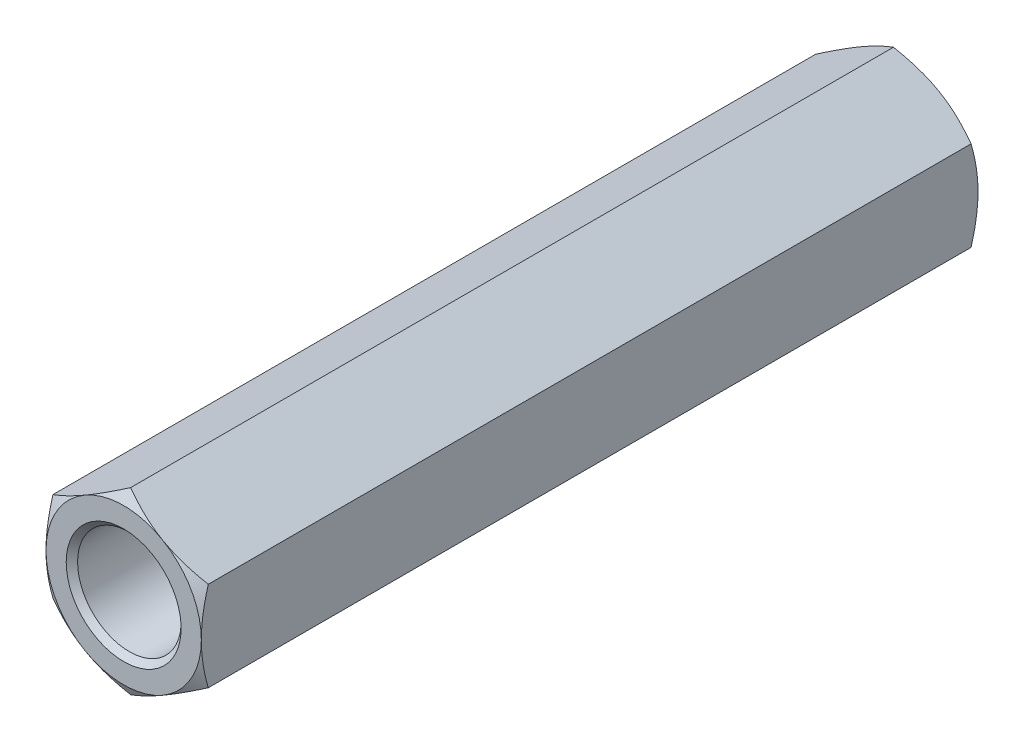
ISO-10303-21;
HEADER;
FILE_DESCRIPTION(('STEP AP214'),'2;1');
FILE_NAME('part.step','',(''),(''),'','','');
FILE_SCHEMA(('AUTOMOTIVE_DESIGN { 1 0 10303 214 1 1 1 1 }'));
ENDSEC;
DATA;
#1=APPLICATION_CONTEXT('core data for automotive mechanical design processes');
#2=APPLICATION_PROTOCOL_DEFINITION('international standard','automotive_design',2000,#1);
#3=PRODUCT_CONTEXT('',#1,'mechanical');
#4=PRODUCT('Part','Part','',(#3));
#5=PRODUCT_RELATED_PRODUCT_CATEGORY('part','',(#4));
#6=PRODUCT_DEFINITION_FORMATION('','',#4);
#7=PRODUCT_DEFINITION_CONTEXT('part definition',#1,'design');
#8=PRODUCT_DEFINITION('design','',#6,#7);
#9=PRODUCT_DEFINITION_SHAPE('','',#8);
#10=(LENGTH_UNIT() NAMED_UNIT(*) SI_UNIT(.MILLI.,.METRE.));
#11=(NAMED_UNIT(*) PLANE_ANGLE_UNIT() SI_UNIT($,.RADIAN.));
#12=(NAMED_UNIT(*) SI_UNIT($,.STERADIAN.) SOLID_ANGLE_UNIT());
#13=UNCERTAINTY_MEASURE_WITH_UNIT(LENGTH_MEASURE(1.E-05),#10,'distance_accuracy_value','');
#14=(GEOMETRIC_REPRESENTATION_CONTEXT(3) GLOBAL_UNCERTAINTY_ASSIGNED_CONTEXT((#13)) GLOBAL_UNIT_ASSIGNED_CONTEXT((#10,
#11,#12)) REPRESENTATION_CONTEXT('',''));
#15=CARTESIAN_POINT('',(0.,0.,0.));
#16=DIRECTION('',(0.,0.,1.));
#17=DIRECTION('',(1.,0.,0.));
#18=AXIS2_PLACEMENT_3D('',#15,#16,#17);
#19=CARTESIAN_POINT('',(15.,8.6602540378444,150.));
#20=DIRECTION('',(-0.5,-0.866025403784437,0.));
#21=DIRECTION('',(-0.866025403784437,0.5,0.));
#22=AXIS2_PLACEMENT_3D('',#19,#20,#21);
#23=PLANE('',#22);
#24=CARTESIAN_POINT('',(-0.000200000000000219,17.3206235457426,1.33981262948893));
#25=CARTESIAN_POINT('',(0.329494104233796,17.130274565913,1.22992178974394));
#26=CARTESIAN_POINT('',(0.660474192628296,16.9391831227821,1.12501758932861));
#27=CARTESIAN_POINT('',(1.32508844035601,16.5554679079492,0.92656858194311));
#28=CARTESIAN_POINT('',(1.6587234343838,16.3628436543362,0.833027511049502));
#29=CARTESIAN_POINT('',(2.32929228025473,15.9756905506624,0.658562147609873));
#30=CARTESIAN_POINT('',(2.66623200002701,15.7811583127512,0.577667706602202));
#31=CARTESIAN_POINT('',(3.34245276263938,15.3907420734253,0.43023264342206));
#32=CARTESIAN_POINT('',(3.68173367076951,15.1948581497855,0.363691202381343));
#33=CARTESIAN_POINT('',(4.35394314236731,14.8067578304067,0.247792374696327));
#34=CARTESIAN_POINT('',(4.68682180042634,14.6145702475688,0.198051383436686));
#35=CARTESIAN_POINT('',(5.35410443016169,14.2293144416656,0.114646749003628));
#36=CARTESIAN_POINT('',(5.68850843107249,14.0362462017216,0.0809834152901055));
#37=CARTESIAN_POINT('',(6.35787818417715,13.6497853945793,0.0305840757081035));
#38=CARTESIAN_POINT('',(6.69284279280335,13.4563934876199,0.0138279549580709));
#39=CARTESIAN_POINT('',(7.363081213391,13.0694311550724,-0.00239660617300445));
#40=CARTESIAN_POINT('',(7.69835501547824,12.8758607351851,-0.0018655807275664));
#41=CARTESIAN_POINT('',(8.32514688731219,12.5139822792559,0.0152766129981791));
#42=CARTESIAN_POINT('',(8.61670962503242,12.3456484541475,0.0297968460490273));
#43=CARTESIAN_POINT('',(9.19916443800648,12.0093680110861,0.071637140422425));
#44=CARTESIAN_POINT('',(9.49005646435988,11.8414214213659,0.0989581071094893));
#45=CARTESIAN_POINT('',(10.0710118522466,11.5060066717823,0.165923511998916));
#46=CARTESIAN_POINT('',(10.3610743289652,11.338539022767,0.205578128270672));
#47=CARTESIAN_POINT('',(10.939839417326,11.0043888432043,0.296515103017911));
#48=CARTESIAN_POINT('',(11.2285419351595,10.8377063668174,0.347798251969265));
#49=CARTESIAN_POINT('',(12.1049144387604,10.3317324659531,0.520386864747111));
#50=CARTESIAN_POINT('',(12.6900465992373,9.99390625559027,0.658901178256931));
#51=CARTESIAN_POINT('',(13.8515859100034,9.32329122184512,0.973271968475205));
#52=CARTESIAN_POINT('',(14.4280079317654,8.99049381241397,1.14905461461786));
#53=CARTESIAN_POINT('',(15.0002,8.66013856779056,1.33981262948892));
#54=B_SPLINE_CURVE_WITH_KNOTS('',3,(#24,#25,#26,#27,#28,#29,#30,#31,#32,#33,#34,#35,#36,#37,#38,
#39,#40,#41,#42,#43,#44,#45,#46,#47,#48,#49,#50,#51,#52,#53),.UNSPECIFIED.,.F.,.F.,(4,2,2,2,2,2,
2,2,2,2,2,2,2,2,4),(0.,1.18875411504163,2.37789802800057,3.56980778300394,4.76164951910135,
5.92407379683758,7.08652044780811,8.24758247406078,9.40860862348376,10.4193068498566,
11.4300765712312,12.4416826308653,13.4533574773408,15.5211962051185,17.5849760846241),.UNSPECIFIED.);
#55=CARTESIAN_POINT('',(0.,17.3205080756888,1.33974596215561));
#56=VERTEX_POINT('',#55);
#57=CARTESIAN_POINT('',(7.5,12.9903810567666,0.));
#58=VERTEX_POINT('',#57);
#59=EDGE_CURVE('E330',#56,#58,#54,.T.);
#60=ORIENTED_EDGE('',*,*,#59,.F.);
#61=DIRECTION('',(0.,0.,-1.));
#62=VECTOR('',#61,1.);
#63=CARTESIAN_POINT('',(0.,17.3205080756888,150.));
#64=LINE('',#63,#62);
#65=CARTESIAN_POINT('',(0.,17.3205080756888,148.660254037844));
#66=VERTEX_POINT('',#65);
#67=EDGE_CURVE('E239',#66,#56,#64,.T.);
#68=ORIENTED_EDGE('',*,*,#67,.F.);
#69=CARTESIAN_POINT('',(15.0002,8.66013856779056,148.660187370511));
#70=CARTESIAN_POINT('',(14.6705058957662,8.85048754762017,148.770078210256));
#71=CARTESIAN_POINT('',(14.3395258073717,9.04157899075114,148.874982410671));
#72=CARTESIAN_POINT('',(13.674911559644,9.425294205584,149.073431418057));
#73=CARTESIAN_POINT('',(13.3412765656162,9.61791845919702,149.166972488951));
#74=CARTESIAN_POINT('',(12.6707077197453,10.0050715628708,149.34143785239));
#75=CARTESIAN_POINT('',(12.333767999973,10.199603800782,149.422332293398));
#76=CARTESIAN_POINT('',(11.6575472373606,10.5900200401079,149.569767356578));
#77=CARTESIAN_POINT('',(11.3182663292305,10.7859039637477,149.636308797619));
#78=CARTESIAN_POINT('',(10.6460568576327,11.1740042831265,149.752207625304));
#79=CARTESIAN_POINT('',(10.3131781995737,11.3661918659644,149.801948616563));
#80=CARTESIAN_POINT('',(9.6458955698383,11.7514476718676,149.885353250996));
#81=CARTESIAN_POINT('',(9.31149156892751,11.9445159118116,149.91901658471));
#82=CARTESIAN_POINT('',(8.64212181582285,12.3309767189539,149.969415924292));
#83=CARTESIAN_POINT('',(8.30715720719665,12.5243686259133,149.986172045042));
#84=CARTESIAN_POINT('',(7.636918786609,12.9113309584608,150.002396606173));
#85=CARTESIAN_POINT('',(7.30164498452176,13.1049013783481,150.001865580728));
#86=CARTESIAN_POINT('',(6.6748531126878,13.4667798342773,149.984723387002));
#87=CARTESIAN_POINT('',(6.38329037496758,13.6351136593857,149.970203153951));
#88=CARTESIAN_POINT('',(5.80083556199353,13.9713941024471,149.928362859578));
#89=CARTESIAN_POINT('',(5.50994353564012,14.1393406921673,149.901041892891));
#90=CARTESIAN_POINT('',(4.92898814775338,14.4747554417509,149.834076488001));
#91=CARTESIAN_POINT('',(4.63892567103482,14.6422230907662,149.794421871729));
#92=CARTESIAN_POINT('',(4.06016058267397,14.9763732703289,149.703484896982));
#93=CARTESIAN_POINT('',(3.77145806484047,15.1430557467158,149.652201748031));
#94=CARTESIAN_POINT('',(2.89508556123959,15.6490296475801,149.479613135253));
#95=CARTESIAN_POINT('',(2.30995340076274,15.9868558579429,149.341098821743));
#96=CARTESIAN_POINT('',(1.14841408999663,16.6574708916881,149.026728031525));
#97=CARTESIAN_POINT('',(0.571992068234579,16.9902683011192,148.850945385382));
#98=CARTESIAN_POINT('',(-0.000200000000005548,17.3206235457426,148.660187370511));
#99=B_SPLINE_CURVE_WITH_KNOTS('',3,(#69,#70,#71,#72,#73,#74,#75,#76,#77,#78,#79,#80,#81,#82,#83,
#84,#85,#86,#87,#88,#89,#90,#91,#92,#93,#94,#95,#96,#97,#98),.UNSPECIFIED.,.F.,.F.,(4,2,2,2,2,2,
2,2,2,2,2,2,2,2,4),(0.,1.18875411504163,2.37789802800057,3.56980778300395,4.76164951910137,
5.92407379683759,7.08652044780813,8.24758247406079,9.40860862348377,10.4193068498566,
11.4300765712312,12.4416826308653,13.4533574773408,15.5211962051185,17.5849760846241),.UNSPECIFIED.);
#100=CARTESIAN_POINT('',(7.5,12.9903810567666,150.));
#101=VERTEX_POINT('',#100);
#102=EDGE_CURVE('E225',#101,#66,#99,.T.);
#103=ORIENTED_EDGE('',*,*,#102,.F.);
#104=CARTESIAN_POINT('',(15.,8.6602540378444,148.660254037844));
#105=VERTEX_POINT('',#104);
#106=EDGE_CURVE('E301',#105,#101,#99,.T.);
#107=ORIENTED_EDGE('',*,*,#106,.F.);
#108=DIRECTION('',(0.,0.,-1.));
#109=VECTOR('',#108,1.);
#110=CARTESIAN_POINT('',(15.,8.6602540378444,150.));
#111=LINE('',#110,#109);
#112=CARTESIAN_POINT('',(15.,8.6602540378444,1.33974596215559));
#113=VERTEX_POINT('',#112);
#114=EDGE_CURVE('E227',#105,#113,#111,.T.);
#115=ORIENTED_EDGE('',*,*,#114,.T.);
#116=EDGE_CURVE('E37',#58,#113,#54,.T.);
#117=ORIENTED_EDGE('',*,*,#116,.F.);
#118=EDGE_LOOP('',(#60,#68,#103,#107,#115,#117));
#119=FACE_BOUND('',#118,.T.);
#120=ADVANCED_FACE('F14',(#119),#23,.F.);
#121=CARTESIAN_POINT('',(-15.,8.6602540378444,150.));
#122=DIRECTION('',(-0.5,0.866025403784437,0.));
#123=DIRECTION('',(0.866025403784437,0.5,0.));
#124=AXIS2_PLACEMENT_3D('',#121,#122,#123);
#125=PLANE('',#124);
#126=ORIENTED_EDGE('',*,*,#67,.T.);
#127=CARTESIAN_POINT('',(0.000200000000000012,17.3206235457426,1.33981262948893));
#128=CARTESIAN_POINT('',(-0.329494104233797,17.130274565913,1.22992178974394));
#129=CARTESIAN_POINT('',(-0.660474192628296,16.9391831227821,1.12501758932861));
#130=CARTESIAN_POINT('',(-1.32508844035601,16.5554679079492,0.92656858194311));
#131=CARTESIAN_POINT('',(-1.6587234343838,16.3628436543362,0.833027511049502));
#132=CARTESIAN_POINT('',(-2.32929228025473,15.9756905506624,0.658562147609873));
#133=CARTESIAN_POINT('',(-2.66623200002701,15.7811583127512,0.577667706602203));
#134=CARTESIAN_POINT('',(-3.34245276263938,15.3907420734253,0.43023264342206));
#135=CARTESIAN_POINT('',(-3.68173367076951,15.1948581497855,0.363691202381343));
#136=CARTESIAN_POINT('',(-4.35394314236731,14.8067578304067,0.247792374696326));
#137=CARTESIAN_POINT('',(-4.68682180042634,14.6145702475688,0.198051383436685));
#138=CARTESIAN_POINT('',(-5.35410443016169,14.2293144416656,0.114646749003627));
#139=CARTESIAN_POINT('',(-5.68850843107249,14.0362462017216,0.0809834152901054));
#140=CARTESIAN_POINT('',(-6.35787818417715,13.6497853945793,0.030584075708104));
#141=CARTESIAN_POINT('',(-6.69284279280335,13.4563934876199,0.0138279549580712));
#142=CARTESIAN_POINT('',(-7.363081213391,13.0694311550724,-0.00239660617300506));
#143=CARTESIAN_POINT('',(-7.69835501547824,12.8758607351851,-0.00186558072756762));
#144=CARTESIAN_POINT('',(-8.3251468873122,12.5139822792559,0.015276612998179));
#145=CARTESIAN_POINT('',(-8.61670962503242,12.3456484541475,0.0297968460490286));
#146=CARTESIAN_POINT('',(-9.19916443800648,12.0093680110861,0.0716371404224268));
#147=CARTESIAN_POINT('',(-9.49005646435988,11.8414214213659,0.0989581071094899));
#148=CARTESIAN_POINT('',(-10.0710118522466,11.5060066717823,0.165923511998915));
#149=CARTESIAN_POINT('',(-10.3610743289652,11.338539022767,0.205578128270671));
#150=CARTESIAN_POINT('',(-10.939839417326,11.0043888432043,0.296515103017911));
#151=CARTESIAN_POINT('',(-11.2285419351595,10.8377063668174,0.347798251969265));
#152=CARTESIAN_POINT('',(-12.1049144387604,10.3317324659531,0.520386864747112));
#153=CARTESIAN_POINT('',(-12.6900465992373,9.99390625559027,0.658901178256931));
#154=CARTESIAN_POINT('',(-13.8515859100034,9.32329122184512,0.973271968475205));
#155=CARTESIAN_POINT('',(-14.4280079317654,8.99049381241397,1.14905461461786));
#156=CARTESIAN_POINT('',(-15.0002,8.66013856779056,1.33981262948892));
#157=B_SPLINE_CURVE_WITH_KNOTS('',3,(#127,#128,#129,#130,#131,#132,#133,#134,#135,#136,#137,
#138,#139,#140,#141,#142,#143,#144,#145,#146,#147,#148,#149,#150,#151,#152,#153,#154,#155,#156),
.UNSPECIFIED.,.F.,.F.,(4,2,2,2,2,2,2,2,2,2,2,2,2,2,4),(0.,1.18875411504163,2.37789802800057,
3.56980778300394,4.76164951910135,5.92407379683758,7.08652044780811,8.24758247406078,
9.40860862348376,10.4193068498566,11.4300765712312,12.4416826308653,13.4533574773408,
15.5211962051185,17.5849760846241),.UNSPECIFIED.);
#158=CARTESIAN_POINT('',(-7.5,12.9903810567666,0.));
#159=VERTEX_POINT('',#158);
#160=EDGE_CURVE('E184',#56,#159,#157,.T.);
#161=ORIENTED_EDGE('',*,*,#160,.T.);
#162=CARTESIAN_POINT('',(-15.,8.6602540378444,1.33974596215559));
#163=VERTEX_POINT('',#162);
#164=EDGE_CURVE('E319',#159,#163,#157,.T.);
#165=ORIENTED_EDGE('',*,*,#164,.T.);
#166=DIRECTION('',(0.,0.,-1.));
#167=VECTOR('',#166,1.);
#168=CARTESIAN_POINT('',(-15.,8.6602540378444,150.));
#169=LINE('',#168,#167);
#170=CARTESIAN_POINT('',(-15.,8.6602540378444,148.660254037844));
#171=VERTEX_POINT('',#170);
#172=EDGE_CURVE('E236',#171,#163,#169,.T.);
#173=ORIENTED_EDGE('',*,*,#172,.F.);
#174=CARTESIAN_POINT('',(-15.0002,8.66013856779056,148.660187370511));
#175=CARTESIAN_POINT('',(-14.6705058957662,8.85048754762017,148.770078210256));
#176=CARTESIAN_POINT('',(-14.3395258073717,9.04157899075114,148.874982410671));
#177=CARTESIAN_POINT('',(-13.674911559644,9.425294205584,149.073431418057));
#178=CARTESIAN_POINT('',(-13.3412765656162,9.61791845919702,149.166972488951));
#179=CARTESIAN_POINT('',(-12.6707077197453,10.0050715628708,149.34143785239));
#180=CARTESIAN_POINT('',(-12.333767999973,10.199603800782,149.422332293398));
#181=CARTESIAN_POINT('',(-11.6575472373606,10.5900200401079,149.569767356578));
#182=CARTESIAN_POINT('',(-11.3182663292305,10.7859039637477,149.636308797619));
#183=CARTESIAN_POINT('',(-10.6460568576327,11.1740042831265,149.752207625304));
#184=CARTESIAN_POINT('',(-10.3131781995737,11.3661918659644,149.801948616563));
#185=CARTESIAN_POINT('',(-9.6458955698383,11.7514476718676,149.885353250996));
#186=CARTESIAN_POINT('',(-9.31149156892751,11.9445159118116,149.91901658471));
#187=CARTESIAN_POINT('',(-8.64212181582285,12.3309767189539,149.969415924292));
#188=CARTESIAN_POINT('',(-8.30715720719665,12.5243686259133,149.986172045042));
#189=CARTESIAN_POINT('',(-7.636918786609,12.9113309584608,150.002396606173));
#190=CARTESIAN_POINT('',(-7.30164498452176,13.1049013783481,150.001865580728));
#191=CARTESIAN_POINT('',(-6.6748531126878,13.4667798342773,149.984723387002));
#192=CARTESIAN_POINT('',(-6.38329037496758,13.6351136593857,149.970203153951));
#193=CARTESIAN_POINT('',(-5.80083556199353,13.9713941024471,149.928362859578));
#194=CARTESIAN_POINT('',(-5.50994353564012,14.1393406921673,149.901041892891));
#195=CARTESIAN_POINT('',(-4.92898814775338,14.4747554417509,149.834076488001));
#196=CARTESIAN_POINT('',(-4.63892567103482,14.6422230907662,149.794421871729));
#197=CARTESIAN_POINT('',(-4.06016058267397,14.9763732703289,149.703484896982));
#198=CARTESIAN_POINT('',(-3.77145806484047,15.1430557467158,149.652201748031));
#199=CARTESIAN_POINT('',(-2.89508556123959,15.6490296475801,149.479613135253));
#200=CARTESIAN_POINT('',(-2.30995340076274,15.9868558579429,149.341098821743));
#201=CARTESIAN_POINT('',(-1.14841408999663,16.6574708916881,149.026728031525));
#202=CARTESIAN_POINT('',(-0.571992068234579,16.9902683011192,148.850945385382));
#203=CARTESIAN_POINT('',(0.000200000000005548,17.3206235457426,148.660187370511));
#204=B_SPLINE_CURVE_WITH_KNOTS('',3,(#174,#175,#176,#177,#178,#179,#180,#181,#182,#183,#184,
#185,#186,#187,#188,#189,#190,#191,#192,#193,#194,#195,#196,#197,#198,#199,#200,#201,#202,#203),
.UNSPECIFIED.,.F.,.F.,(4,2,2,2,2,2,2,2,2,2,2,2,2,2,4),(0.,1.18875411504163,2.37789802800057,
3.56980778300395,4.76164951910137,5.92407379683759,7.08652044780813,8.24758247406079,
9.40860862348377,10.4193068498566,11.4300765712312,12.4416826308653,13.4533574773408,
15.5211962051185,17.5849760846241),.UNSPECIFIED.);
#205=CARTESIAN_POINT('',(-7.5,12.9903810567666,150.));
#206=VERTEX_POINT('',#205);
#207=EDGE_CURVE('E218',#171,#206,#204,.T.);
#208=ORIENTED_EDGE('',*,*,#207,.T.);
#209=EDGE_CURVE('E226',#206,#66,#204,.T.);
#210=ORIENTED_EDGE('',*,*,#209,.T.);
#211=EDGE_LOOP('',(#126,#161,#165,#173,#208,#210));
#212=FACE_BOUND('',#211,.T.);
#213=ADVANCED_FACE('F197',(#212),#125,.T.);
#214=CARTESIAN_POINT('',(-15.,8.6602540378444,150.));
#215=DIRECTION('',(1.,0.,0.));
#216=DIRECTION('',(0.,0.,-1.));
#217=AXIS2_PLACEMENT_3D('',#214,#215,#216);
#218=PLANE('',#217);
#219=CARTESIAN_POINT('',(-15.,-23.3993564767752,7.38686287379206));
#220=CARTESIAN_POINT('',(-15.,-23.0712215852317,7.2273743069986));
#221=CARTESIAN_POINT('',(-15.,-22.7427053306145,7.06867073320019));
#222=CARTESIAN_POINT('',(-15.,-22.0848305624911,6.75301108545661));
#223=CARTESIAN_POINT('',(-15.,-21.7554720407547,6.59605502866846));
#224=CARTESIAN_POINT('',(-15.,-20.7659279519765,6.12803392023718));
#225=CARTESIAN_POINT('',(-15.,-20.1043688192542,5.81986220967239));
#226=CARTESIAN_POINT('',(-15.,-18.7733338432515,5.21144187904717));
#227=CARTESIAN_POINT('',(-15.,-18.1038345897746,4.91124435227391));
#228=CARTESIAN_POINT('',(-15.,-16.7595597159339,4.32294748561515));
#229=CARTESIAN_POINT('',(-15.,-16.0847843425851,4.03484758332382));
#230=CARTESIAN_POINT('',(-15.,-14.7065491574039,3.46470319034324));
#231=CARTESIAN_POINT('',(-15.,-14.0028765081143,3.18317055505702));
#232=CARTESIAN_POINT('',(-15.,-12.5873443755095,2.64108209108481));
#233=CARTESIAN_POINT('',(-15.,-11.8754839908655,2.38052859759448));
#234=CARTESIAN_POINT('',(-15.,-10.4437556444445,1.8871426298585));
#235=CARTESIAN_POINT('',(-15.,-9.72390677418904,1.65425519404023));
#236=CARTESIAN_POINT('',(-15.,-8.27381578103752,1.2235701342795));
#237=CARTESIAN_POINT('',(-15.,-7.54357696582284,1.0257616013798));
#238=CARTESIAN_POINT('',(-15.,-6.44232333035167,0.762992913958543));
#239=CARTESIAN_POINT('',(-15.,-6.07529142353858,0.681242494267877));
#240=CARTESIAN_POINT('',(-15.,-5.33869453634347,0.530015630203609));
#241=CARTESIAN_POINT('',(-15.,-4.96912960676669,0.460538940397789));
#242=CARTESIAN_POINT('',(-15.,-4.22771066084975,0.335077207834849));
#243=CARTESIAN_POINT('',(-15.,-3.85585667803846,0.279091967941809));
#244=CARTESIAN_POINT('',(-15.,-3.11024483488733,0.181725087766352));
#245=CARTESIAN_POINT('',(-15.,-2.73648705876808,0.140342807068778));
#246=CARTESIAN_POINT('',(-15.,-1.992526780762,0.073530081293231));
#247=CARTESIAN_POINT('',(-15.,-1.62234270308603,0.0478957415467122));
#248=CARTESIAN_POINT('',(-15.,-0.881222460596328,0.012311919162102));
#249=CARTESIAN_POINT('',(-15.,-0.510286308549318,0.00236217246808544));
#250=CARTESIAN_POINT('',(-15.,0.231674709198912,-0.00161524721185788));
#251=CARTESIAN_POINT('',(-15.,0.602699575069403,0.00435711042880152));
#252=CARTESIAN_POINT('',(-15.,1.3441638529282,0.0320765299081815));
#253=CARTESIAN_POINT('',(-15.,1.71460323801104,0.0538242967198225));
#254=CARTESIAN_POINT('',(-15.,2.60077635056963,0.124254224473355));
#255=CARTESIAN_POINT('',(-15.,3.11594379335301,0.180192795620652));
#256=CARTESIAN_POINT('',(-15.,4.14254800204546,0.319565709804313));
#257=CARTESIAN_POINT('',(-15.,4.65398426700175,0.403003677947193));
#258=CARTESIAN_POINT('',(-15.,5.67260716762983,0.594407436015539));
#259=CARTESIAN_POINT('',(-15.,6.17979025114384,0.702391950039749));
#260=CARTESIAN_POINT('',(-15.,7.18911435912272,0.939585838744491));
#261=CARTESIAN_POINT('',(-15.,7.69125545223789,1.06879492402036));
#262=CARTESIAN_POINT('',(-15.,8.70161460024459,1.34836058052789));
#263=CARTESIAN_POINT('',(-15.,9.20971940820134,1.49912359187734));
#264=CARTESIAN_POINT('',(-15.,10.2209256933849,1.81650144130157));
#265=CARTESIAN_POINT('',(-15.,10.7240271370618,1.98311638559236));
#266=CARTESIAN_POINT('',(-15.,11.7254704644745,2.32952866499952));
#267=CARTESIAN_POINT('',(-15.,12.2238138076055,2.50932180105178));
#268=CARTESIAN_POINT('',(-15.,13.216352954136,2.87994837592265));
#269=CARTESIAN_POINT('',(-15.,13.7105488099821,3.07078167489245));
#270=CARTESIAN_POINT('',(-15.,14.8913212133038,3.53948878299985));
#271=CARTESIAN_POINT('',(-15.,15.5761478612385,3.82176472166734));
#272=CARTESIAN_POINT('',(-15.,16.9398310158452,4.40042924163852));
#273=CARTESIAN_POINT('',(-15.,17.6186871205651,4.69681876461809));
#274=CARTESIAN_POINT('',(-15.,18.9715629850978,5.30083807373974));
#275=CARTESIAN_POINT('',(-15.,19.6455815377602,5.60847055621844));
#276=CARTESIAN_POINT('',(-15.,20.9894397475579,6.23266829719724));
#277=CARTESIAN_POINT('',(-15.,21.659279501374,6.5492333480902));
#278=CARTESIAN_POINT('',(-15.,22.9962583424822,7.18997020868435));
#279=CARTESIAN_POINT('',(-15.,23.6633934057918,7.51415039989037));
#280=CARTESIAN_POINT('',(-15.,24.9947465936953,8.16844535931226));
#281=CARTESIAN_POINT('',(-15.,25.6589647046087,8.49856015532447));
#282=CARTESIAN_POINT('',(-15.,26.9848487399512,9.16364699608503));
#283=CARTESIAN_POINT('',(-15.,27.6465149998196,9.49861837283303));
#284=CARTESIAN_POINT('',(-15.,28.9677553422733,10.1726546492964));
#285=CARTESIAN_POINT('',(-15.,29.6273294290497,10.5117195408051));
#286=CARTESIAN_POINT('',(-15.,31.4899863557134,11.4753917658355));
#287=CARTESIAN_POINT('',(-15.,32.6909909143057,12.1040159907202));
#288=CARTESIAN_POINT('',(-15.,35.0885373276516,13.3698075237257));
#289=CARTESIAN_POINT('',(-15.,36.2850790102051,14.0069751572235));
#290=CARTESIAN_POINT('',(-15.,38.6715403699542,15.2861585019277));
#291=CARTESIAN_POINT('',(-15.,39.8614691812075,15.9281571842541));
#292=CARTESIAN_POINT('',(-15.,41.6442646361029,16.8949372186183));
#293=CARTESIAN_POINT('',(-15.,42.2381632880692,17.217818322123));
#294=CARTESIAN_POINT('',(-15.,43.4253415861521,17.8647144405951));
#295=CARTESIAN_POINT('',(-15.,44.0186212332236,18.1887294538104));
#296=CARTESIAN_POINT('',(-15.,44.6116267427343,18.5132455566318));
#297=B_SPLINE_CURVE_WITH_KNOTS('',3,(#219,#220,#221,#222,#223,#224,#225,#226,#227,#228,#229,
#230,#231,#232,#233,#234,#235,#236,#237,#238,#239,#240,#241,#242,#243,#244,#245,#246,#247,#248,
#249,#250,#251,#252,#253,#254,#255,#256,#257,#258,#259,#260,#261,#262,#263,#264,#265,#266,#267,
#268,#269,#270,#271,#272,#273,#274,#275,#276,#277,#278,#279,#280,#281,#282,#283,#284,#285,#286,
#287,#288,#289,#290,#291,#292,#293,#294,#295,#296),.UNSPECIFIED.,.F.,.F.,(4,2,2,2,2,2,2,2,2,2,2,
2,2,2,2,2,2,2,2,2,2,2,2,2,2,2,2,2,2,2,2,2,2,2,2,2,2,2,4),(0.,1.09452169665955,2.18905412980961,
4.3784358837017,6.57950821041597,8.7804780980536,11.0539293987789,13.3276334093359,
15.5967421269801,17.8651439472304,18.9930499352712,20.1209333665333,21.2488003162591,
22.3766177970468,23.4895070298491,24.6023775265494,25.7152501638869,26.8281725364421,
28.3819024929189,29.9358373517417,31.4909615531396,33.0460645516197,34.6357559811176,
36.2254580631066,37.814655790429,39.4038333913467,41.6257788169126,43.8478727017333,
46.0705030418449,48.2930817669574,50.518233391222,52.7433954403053,54.9682542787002,
57.1931086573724,61.2597778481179,65.3266023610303,69.3827950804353,71.4107760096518,
73.4387538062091),.UNSPECIFIED.);
#298=CARTESIAN_POINT('',(-15.,-8.6602540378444,1.33974596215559));
#299=VERTEX_POINT('',#298);
#300=CARTESIAN_POINT('',(-15.,0.,0.));
#301=VERTEX_POINT('',#300);
#302=EDGE_CURVE('E178',#299,#301,#297,.T.);
#303=ORIENTED_EDGE('',*,*,#302,.F.);
#304=DIRECTION('',(0.,0.,-1.));
#305=VECTOR('',#304,1.);
#306=CARTESIAN_POINT('',(-15.,-8.6602540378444,150.));
#307=LINE('',#306,#305);
#308=CARTESIAN_POINT('',(-15.,-8.6602540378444,148.660254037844));
#309=VERTEX_POINT('',#308);
#310=EDGE_CURVE('E233',#309,#299,#307,.T.);
#311=ORIENTED_EDGE('',*,*,#310,.F.);
#312=CARTESIAN_POINT('',(-15.,-23.3993564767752,142.613137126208));
#313=CARTESIAN_POINT('',(-15.,-23.0712215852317,142.772625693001));
#314=CARTESIAN_POINT('',(-15.,-22.7427053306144,142.9313292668));
#315=CARTESIAN_POINT('',(-15.,-22.0848305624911,143.246988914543));
#316=CARTESIAN_POINT('',(-15.,-21.7554720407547,143.403944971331));
#317=CARTESIAN_POINT('',(-15.,-20.7659279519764,143.871966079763));
#318=CARTESIAN_POINT('',(-15.,-20.1043688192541,144.180137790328));
#319=CARTESIAN_POINT('',(-15.,-18.7733338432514,144.788558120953));
#320=CARTESIAN_POINT('',(-15.,-18.1038345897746,145.088755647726));
#321=CARTESIAN_POINT('',(-15.,-16.7595597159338,145.677052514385));
#322=CARTESIAN_POINT('',(-15.,-16.084784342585,145.965152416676));
#323=CARTESIAN_POINT('',(-15.,-14.7065491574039,146.535296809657));
#324=CARTESIAN_POINT('',(-15.,-14.0028765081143,146.816829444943));
#325=CARTESIAN_POINT('',(-15.,-12.5873443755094,147.358917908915));
#326=CARTESIAN_POINT('',(-15.,-11.8754839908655,147.619471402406));
#327=CARTESIAN_POINT('',(-15.,-10.4437556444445,148.112857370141));
#328=CARTESIAN_POINT('',(-15.,-9.72390677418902,148.34574480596));
#329=CARTESIAN_POINT('',(-15.,-8.27381578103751,148.776429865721));
#330=CARTESIAN_POINT('',(-15.,-7.54357696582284,148.97423839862));
#331=CARTESIAN_POINT('',(-15.,-6.44232333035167,149.237007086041));
#332=CARTESIAN_POINT('',(-15.,-6.07529142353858,149.318757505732));
#333=CARTESIAN_POINT('',(-15.,-5.33869453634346,149.469984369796));
#334=CARTESIAN_POINT('',(-15.,-4.96912960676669,149.539461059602));
#335=CARTESIAN_POINT('',(-15.,-4.22771066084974,149.664922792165));
#336=CARTESIAN_POINT('',(-15.,-3.85585667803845,149.720908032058));
#337=CARTESIAN_POINT('',(-15.,-3.11024483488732,149.818274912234));
#338=CARTESIAN_POINT('',(-15.,-2.73648705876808,149.859657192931));
#339=CARTESIAN_POINT('',(-15.,-1.99252678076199,149.926469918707));
#340=CARTESIAN_POINT('',(-15.,-1.62234270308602,149.952104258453));
#341=CARTESIAN_POINT('',(-15.,-0.881222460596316,149.987688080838));
#342=CARTESIAN_POINT('',(-15.,-0.510286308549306,149.997637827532));
#343=CARTESIAN_POINT('',(-15.,0.231674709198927,150.001615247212));
#344=CARTESIAN_POINT('',(-15.,0.602699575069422,149.995642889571));
#345=CARTESIAN_POINT('',(-15.,1.34416385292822,149.967923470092));
#346=CARTESIAN_POINT('',(-15.,1.71460323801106,149.94617570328));
#347=CARTESIAN_POINT('',(-15.,2.60077635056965,149.875745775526));
#348=CARTESIAN_POINT('',(-15.,3.11594379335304,149.819807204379));
#349=CARTESIAN_POINT('',(-15.,4.14254800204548,149.680434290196));
#350=CARTESIAN_POINT('',(-15.,4.65398426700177,149.596996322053));
#351=CARTESIAN_POINT('',(-15.,5.67260716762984,149.405592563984));
#352=CARTESIAN_POINT('',(-15.,6.17979025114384,149.29760804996));
#353=CARTESIAN_POINT('',(-15.,7.18911435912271,149.060414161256));
#354=CARTESIAN_POINT('',(-15.,7.69125545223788,148.93120507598));
#355=CARTESIAN_POINT('',(-15.,8.70161460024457,148.651639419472));
#356=CARTESIAN_POINT('',(-15.,9.20971940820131,148.500876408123));
#357=CARTESIAN_POINT('',(-15.,10.2209256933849,148.183498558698));
#358=CARTESIAN_POINT('',(-15.,10.7240271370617,148.016883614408));
#359=CARTESIAN_POINT('',(-15.,11.7254704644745,147.670471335));
#360=CARTESIAN_POINT('',(-15.,12.2238138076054,147.490678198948));
#361=CARTESIAN_POINT('',(-15.,13.2163529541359,147.120051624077));
#362=CARTESIAN_POINT('',(-15.,13.710548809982,146.929218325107));
#363=CARTESIAN_POINT('',(-15.,14.8913212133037,146.460511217));
#364=CARTESIAN_POINT('',(-15.,15.5761478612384,146.178235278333));
#365=CARTESIAN_POINT('',(-15.,16.9398310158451,145.599570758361));
#366=CARTESIAN_POINT('',(-15.,17.618687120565,145.303181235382));
#367=CARTESIAN_POINT('',(-15.,18.9715629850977,144.69916192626));
#368=CARTESIAN_POINT('',(-15.,19.6455815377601,144.391529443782));
#369=CARTESIAN_POINT('',(-15.,20.9894397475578,143.767331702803));
#370=CARTESIAN_POINT('',(-15.,21.6592795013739,143.45076665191));
#371=CARTESIAN_POINT('',(-15.,22.9962583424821,142.810029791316));
#372=CARTESIAN_POINT('',(-15.,23.6633934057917,142.48584960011));
#373=CARTESIAN_POINT('',(-15.,24.9947465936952,141.831554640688));
#374=CARTESIAN_POINT('',(-15.,25.6589647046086,141.501439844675));
#375=CARTESIAN_POINT('',(-15.,26.9848487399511,140.836353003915));
#376=CARTESIAN_POINT('',(-15.,27.6465149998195,140.501381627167));
#377=CARTESIAN_POINT('',(-15.,28.9677553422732,139.827345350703));
#378=CARTESIAN_POINT('',(-15.,29.6273294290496,139.488280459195));
#379=CARTESIAN_POINT('',(-15.,31.4899863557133,138.524608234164));
#380=CARTESIAN_POINT('',(-15.,32.6909909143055,137.89598400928));
#381=CARTESIAN_POINT('',(-15.,35.0885373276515,136.630192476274));
#382=CARTESIAN_POINT('',(-15.,36.285079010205,135.993024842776));
#383=CARTESIAN_POINT('',(-15.,38.671540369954,134.713841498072));
#384=CARTESIAN_POINT('',(-15.,39.8614691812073,134.071842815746));
#385=CARTESIAN_POINT('',(-15.,41.6442646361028,133.105062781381));
#386=CARTESIAN_POINT('',(-15.,42.2381632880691,132.782181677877));
#387=CARTESIAN_POINT('',(-15.,43.425341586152,132.135285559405));
#388=CARTESIAN_POINT('',(-15.,44.0186212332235,131.811270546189));
#389=CARTESIAN_POINT('',(-15.,44.6116267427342,131.486754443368));
#390=B_SPLINE_CURVE_WITH_KNOTS('',3,(#312,#313,#314,#315,#316,#317,#318,#319,#320,#321,#322,
#323,#324,#325,#326,#327,#328,#329,#330,#331,#332,#333,#334,#335,#336,#337,#338,#339,#340,#341,
#342,#343,#344,#345,#346,#347,#348,#349,#350,#351,#352,#353,#354,#355,#356,#357,#358,#359,#360,
#361,#362,#363,#364,#365,#366,#367,#368,#369,#370,#371,#372,#373,#374,#375,#376,#377,#378,#379,
#380,#381,#382,#383,#384,#385,#386,#387,#388,#389),.UNSPECIFIED.,.F.,.F.,(4,2,2,2,2,2,2,2,2,2,2,
2,2,2,2,2,2,2,2,2,2,2,2,2,2,2,2,2,2,2,2,2,2,2,2,2,2,2,4),(0.,1.09452169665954,2.18905412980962,
4.3784358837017,6.57950821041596,8.7804780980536,11.0539293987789,13.3276334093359,
15.59674212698,17.8651439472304,18.9930499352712,20.1209333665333,21.248800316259,
22.3766177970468,23.4895070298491,24.6023775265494,25.7152501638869,26.8281725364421,
28.3819024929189,29.9358373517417,31.4909615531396,33.0460645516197,34.6357559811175,
36.2254580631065,37.8146557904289,39.4038333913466,41.6257788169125,43.8478727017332,
46.0705030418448,48.2930817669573,50.5182333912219,52.7433954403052,54.9682542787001,
57.1931086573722,61.2597778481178,65.3266023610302,69.3827950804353,71.4107760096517,
73.438753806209),.UNSPECIFIED.);
#391=CARTESIAN_POINT('',(-15.,0.,150.));
#392=VERTEX_POINT('',#391);
#393=EDGE_CURVE('E203',#392,#309,#390,.F.);
#394=ORIENTED_EDGE('',*,*,#393,.F.);
#395=EDGE_CURVE('E210',#171,#392,#390,.F.);
#396=ORIENTED_EDGE('',*,*,#395,.F.);
#397=ORIENTED_EDGE('',*,*,#172,.T.);
#398=EDGE_CURVE('E186',#301,#163,#297,.T.);
#399=ORIENTED_EDGE('',*,*,#398,.F.);
#400=EDGE_LOOP('',(#303,#311,#394,#396,#397,#399));
#401=FACE_BOUND('',#400,.T.);
#402=ADVANCED_FACE('F193',(#401),#218,.F.);
#403=CARTESIAN_POINT('',(-15.,-8.6602540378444,150.));
#404=DIRECTION('',(0.5,0.866025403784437,0.));
#405=DIRECTION('',(0.866025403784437,-0.5,0.));
#406=AXIS2_PLACEMENT_3D('',#403,#404,#405);
#407=PLANE('',#406);
#408=CARTESIAN_POINT('',(0.000200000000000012,-17.3206235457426,1.33981262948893));
#409=CARTESIAN_POINT('',(-0.329494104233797,-17.130274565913,1.22992178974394));
#410=CARTESIAN_POINT('',(-0.660474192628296,-16.9391831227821,1.12501758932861));
#411=CARTESIAN_POINT('',(-1.32508844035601,-16.5554679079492,0.92656858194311));
#412=CARTESIAN_POINT('',(-1.6587234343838,-16.3628436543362,0.833027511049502));
#413=CARTESIAN_POINT('',(-2.32929228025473,-15.9756905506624,0.658562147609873));
#414=CARTESIAN_POINT('',(-2.66623200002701,-15.7811583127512,0.577667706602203));
#415=CARTESIAN_POINT('',(-3.34245276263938,-15.3907420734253,0.43023264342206));
#416=CARTESIAN_POINT('',(-3.68173367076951,-15.1948581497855,0.363691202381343));
#417=CARTESIAN_POINT('',(-4.35394314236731,-14.8067578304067,0.247792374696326));
#418=CARTESIAN_POINT('',(-4.68682180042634,-14.6145702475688,0.198051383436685));
#419=CARTESIAN_POINT('',(-5.35410443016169,-14.2293144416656,0.114646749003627));
#420=CARTESIAN_POINT('',(-5.68850843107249,-14.0362462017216,0.0809834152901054));
#421=CARTESIAN_POINT('',(-6.35787818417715,-13.6497853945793,0.030584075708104));
#422=CARTESIAN_POINT('',(-6.69284279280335,-13.4563934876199,0.0138279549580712));
#423=CARTESIAN_POINT('',(-7.363081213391,-13.0694311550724,-0.00239660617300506));
#424=CARTESIAN_POINT('',(-7.69835501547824,-12.8758607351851,-0.00186558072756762));
#425=CARTESIAN_POINT('',(-8.3251468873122,-12.5139822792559,0.015276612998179));
#426=CARTESIAN_POINT('',(-8.61670962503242,-12.3456484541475,0.0297968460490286));
#427=CARTESIAN_POINT('',(-9.19916443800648,-12.0093680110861,0.0716371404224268));
#428=CARTESIAN_POINT('',(-9.49005646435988,-11.8414214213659,0.0989581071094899));
#429=CARTESIAN_POINT('',(-10.0710118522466,-11.5060066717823,0.165923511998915));
#430=CARTESIAN_POINT('',(-10.3610743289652,-11.338539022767,0.205578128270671));
#431=CARTESIAN_POINT('',(-10.939839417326,-11.0043888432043,0.296515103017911));
#432=CARTESIAN_POINT('',(-11.2285419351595,-10.8377063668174,0.347798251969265));
#433=CARTESIAN_POINT('',(-12.1049144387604,-10.3317324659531,0.520386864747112));
#434=CARTESIAN_POINT('',(-12.6900465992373,-9.99390625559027,0.658901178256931));
#435=CARTESIAN_POINT('',(-13.8515859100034,-9.32329122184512,0.973271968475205));
#436=CARTESIAN_POINT('',(-14.4280079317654,-8.99049381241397,1.14905461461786));
#437=CARTESIAN_POINT('',(-15.0002,-8.66013856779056,1.33981262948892));
#438=B_SPLINE_CURVE_WITH_KNOTS('',3,(#408,#409,#410,#411,#412,#413,#414,#415,#416,#417,#418,
#419,#420,#421,#422,#423,#424,#425,#426,#427,#428,#429,#430,#431,#432,#433,#434,#435,#436,#437),
.UNSPECIFIED.,.F.,.F.,(4,2,2,2,2,2,2,2,2,2,2,2,2,2,4),(0.,1.18875411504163,2.37789802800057,
3.56980778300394,4.76164951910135,5.92407379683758,7.08652044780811,8.24758247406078,
9.40860862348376,10.4193068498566,11.4300765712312,12.4416826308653,13.4533574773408,
15.5211962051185,17.5849760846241),.UNSPECIFIED.);
#439=CARTESIAN_POINT('',(0.,-17.3205080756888,1.33974596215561));
#440=VERTEX_POINT('',#439);
#441=CARTESIAN_POINT('',(-7.5,-12.9903810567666,0.));
#442=VERTEX_POINT('',#441);
#443=EDGE_CURVE('E166',#440,#442,#438,.T.);
#444=ORIENTED_EDGE('',*,*,#443,.F.);
#445=DIRECTION('',(0.,0.,-1.));
#446=VECTOR('',#445,1.);
#447=CARTESIAN_POINT('',(0.,-17.3205080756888,150.));
#448=LINE('',#447,#446);
#449=CARTESIAN_POINT('',(0.,-17.3205080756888,148.660254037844));
#450=VERTEX_POINT('',#449);
#451=EDGE_CURVE('E230',#450,#440,#448,.T.);
#452=ORIENTED_EDGE('',*,*,#451,.F.);
#453=CARTESIAN_POINT('',(-15.0002,-8.66013856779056,148.660187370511));
#454=CARTESIAN_POINT('',(-14.6705058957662,-8.85048754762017,148.770078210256));
#455=CARTESIAN_POINT('',(-14.3395258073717,-9.04157899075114,148.874982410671));
#456=CARTESIAN_POINT('',(-13.674911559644,-9.425294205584,149.073431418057));
#457=CARTESIAN_POINT('',(-13.3412765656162,-9.61791845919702,149.166972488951));
#458=CARTESIAN_POINT('',(-12.6707077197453,-10.0050715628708,149.34143785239));
#459=CARTESIAN_POINT('',(-12.333767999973,-10.199603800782,149.422332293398));
#460=CARTESIAN_POINT('',(-11.6575472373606,-10.5900200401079,149.569767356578));
#461=CARTESIAN_POINT('',(-11.3182663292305,-10.7859039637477,149.636308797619));
#462=CARTESIAN_POINT('',(-10.6460568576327,-11.1740042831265,149.752207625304));
#463=CARTESIAN_POINT('',(-10.3131781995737,-11.3661918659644,149.801948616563));
#464=CARTESIAN_POINT('',(-9.6458955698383,-11.7514476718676,149.885353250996));
#465=CARTESIAN_POINT('',(-9.31149156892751,-11.9445159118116,149.91901658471));
#466=CARTESIAN_POINT('',(-8.64212181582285,-12.3309767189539,149.969415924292));
#467=CARTESIAN_POINT('',(-8.30715720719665,-12.5243686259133,149.986172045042));
#468=CARTESIAN_POINT('',(-7.636918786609,-12.9113309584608,150.002396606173));
#469=CARTESIAN_POINT('',(-7.30164498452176,-13.1049013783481,150.001865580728));
#470=CARTESIAN_POINT('',(-6.6748531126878,-13.4667798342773,149.984723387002));
#471=CARTESIAN_POINT('',(-6.38329037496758,-13.6351136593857,149.970203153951));
#472=CARTESIAN_POINT('',(-5.80083556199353,-13.9713941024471,149.928362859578));
#473=CARTESIAN_POINT('',(-5.50994353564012,-14.1393406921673,149.901041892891));
#474=CARTESIAN_POINT('',(-4.92898814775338,-14.4747554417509,149.834076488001));
#475=CARTESIAN_POINT('',(-4.63892567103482,-14.6422230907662,149.794421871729));
#476=CARTESIAN_POINT('',(-4.06016058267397,-14.9763732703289,149.703484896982));
#477=CARTESIAN_POINT('',(-3.77145806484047,-15.1430557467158,149.652201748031));
#478=CARTESIAN_POINT('',(-2.89508556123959,-15.6490296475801,149.479613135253));
#479=CARTESIAN_POINT('',(-2.30995340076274,-15.9868558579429,149.341098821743));
#480=CARTESIAN_POINT('',(-1.14841408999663,-16.6574708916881,149.026728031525));
#481=CARTESIAN_POINT('',(-0.571992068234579,-16.9902683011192,148.850945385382));
#482=CARTESIAN_POINT('',(0.000200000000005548,-17.3206235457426,148.660187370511));
#483=B_SPLINE_CURVE_WITH_KNOTS('',3,(#453,#454,#455,#456,#457,#458,#459,#460,#461,#462,#463,
#464,#465,#466,#467,#468,#469,#470,#471,#472,#473,#474,#475,#476,#477,#478,#479,#480,#481,#482),
.UNSPECIFIED.,.F.,.F.,(4,2,2,2,2,2,2,2,2,2,2,2,2,2,4),(0.,1.18875411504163,2.37789802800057,
3.56980778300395,4.76164951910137,5.92407379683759,7.08652044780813,8.24758247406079,
9.40860862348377,10.4193068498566,11.4300765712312,12.4416826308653,13.4533574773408,
15.5211962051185,17.5849760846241),.UNSPECIFIED.);
#484=CARTESIAN_POINT('',(-7.5,-12.9903810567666,150.));
#485=VERTEX_POINT('',#484);
#486=EDGE_CURVE('E212',#485,#450,#483,.T.);
#487=ORIENTED_EDGE('',*,*,#486,.F.);
#488=EDGE_CURVE('E211',#309,#485,#483,.T.);
#489=ORIENTED_EDGE('',*,*,#488,.F.);
#490=ORIENTED_EDGE('',*,*,#310,.T.);
#491=EDGE_CURVE('E185',#442,#299,#438,.T.);
#492=ORIENTED_EDGE('',*,*,#491,.F.);
#493=EDGE_LOOP('',(#444,#452,#487,#489,#490,#492));
#494=FACE_BOUND('',#493,.T.);
#495=ADVANCED_FACE('F196',(#494),#407,.F.);
#496=CARTESIAN_POINT('',(15.,-8.6602540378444,150.));
#497=DIRECTION('',(0.5,-0.866025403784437,0.));
#498=DIRECTION('',(-0.866025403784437,-0.5,0.));
#499=AXIS2_PLACEMENT_3D('',#496,#497,#498);
#500=PLANE('',#499);
#501=ORIENTED_EDGE('',*,*,#451,.T.);
#502=CARTESIAN_POINT('',(-0.000200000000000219,-17.3206235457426,1.33981262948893));
#503=CARTESIAN_POINT('',(0.329494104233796,-17.130274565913,1.22992178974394));
#504=CARTESIAN_POINT('',(0.660474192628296,-16.9391831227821,1.12501758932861));
#505=CARTESIAN_POINT('',(1.32508844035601,-16.5554679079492,0.92656858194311));
#506=CARTESIAN_POINT('',(1.6587234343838,-16.3628436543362,0.833027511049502));
#507=CARTESIAN_POINT('',(2.32929228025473,-15.9756905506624,0.658562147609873));
#508=CARTESIAN_POINT('',(2.66623200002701,-15.7811583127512,0.577667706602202));
#509=CARTESIAN_POINT('',(3.34245276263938,-15.3907420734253,0.43023264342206));
#510=CARTESIAN_POINT('',(3.68173367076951,-15.1948581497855,0.363691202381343));
#511=CARTESIAN_POINT('',(4.35394314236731,-14.8067578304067,0.247792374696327));
#512=CARTESIAN_POINT('',(4.68682180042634,-14.6145702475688,0.198051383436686));
#513=CARTESIAN_POINT('',(5.35410443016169,-14.2293144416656,0.114646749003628));
#514=CARTESIAN_POINT('',(5.68850843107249,-14.0362462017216,0.0809834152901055));
#515=CARTESIAN_POINT('',(6.35787818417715,-13.6497853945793,0.0305840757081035));
#516=CARTESIAN_POINT('',(6.69284279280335,-13.4563934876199,0.0138279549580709));
#517=CARTESIAN_POINT('',(7.363081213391,-13.0694311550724,-0.00239660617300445));
#518=CARTESIAN_POINT('',(7.69835501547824,-12.8758607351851,-0.0018655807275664));
#519=CARTESIAN_POINT('',(8.32514688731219,-12.5139822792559,0.0152766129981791));
#520=CARTESIAN_POINT('',(8.61670962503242,-12.3456484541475,0.0297968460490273));
#521=CARTESIAN_POINT('',(9.19916443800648,-12.0093680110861,0.071637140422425));
#522=CARTESIAN_POINT('',(9.49005646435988,-11.8414214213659,0.0989581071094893));
#523=CARTESIAN_POINT('',(10.0710118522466,-11.5060066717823,0.165923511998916));
#524=CARTESIAN_POINT('',(10.3610743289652,-11.338539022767,0.205578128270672));
#525=CARTESIAN_POINT('',(10.939839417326,-11.0043888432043,0.296515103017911));
#526=CARTESIAN_POINT('',(11.2285419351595,-10.8377063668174,0.347798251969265));
#527=CARTESIAN_POINT('',(12.1049144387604,-10.3317324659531,0.520386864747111));
#528=CARTESIAN_POINT('',(12.6900465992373,-9.99390625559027,0.658901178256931));
#529=CARTESIAN_POINT('',(13.8515859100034,-9.32329122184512,0.973271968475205));
#530=CARTESIAN_POINT('',(14.4280079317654,-8.99049381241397,1.14905461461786));
#531=CARTESIAN_POINT('',(15.0002,-8.66013856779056,1.33981262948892));
#532=B_SPLINE_CURVE_WITH_KNOTS('',3,(#502,#503,#504,#505,#506,#507,#508,#509,#510,#511,#512,
#513,#514,#515,#516,#517,#518,#519,#520,#521,#522,#523,#524,#525,#526,#527,#528,#529,#530,#531),
.UNSPECIFIED.,.F.,.F.,(4,2,2,2,2,2,2,2,2,2,2,2,2,2,4),(0.,1.18875411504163,2.37789802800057,
3.56980778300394,4.76164951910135,5.92407379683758,7.08652044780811,8.24758247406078,
9.40860862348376,10.4193068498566,11.4300765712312,12.4416826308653,13.4533574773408,
15.5211962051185,17.5849760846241),.UNSPECIFIED.);
#533=CARTESIAN_POINT('',(7.5,-12.9903810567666,0.));
#534=VERTEX_POINT('',#533);
#535=EDGE_CURVE('E135',#440,#534,#532,.T.);
#536=ORIENTED_EDGE('',*,*,#535,.T.);
#537=CARTESIAN_POINT('',(15.,-8.6602540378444,1.33974596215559));
#538=VERTEX_POINT('',#537);
#539=EDGE_CURVE('E118',#534,#538,#532,.T.);
#540=ORIENTED_EDGE('',*,*,#539,.T.);
#541=DIRECTION('',(0.,0.,-1.));
#542=VECTOR('',#541,1.);
#543=CARTESIAN_POINT('',(15.,-8.6602540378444,150.));
#544=LINE('',#543,#542);
#545=CARTESIAN_POINT('',(15.,-8.6602540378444,148.660254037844));
#546=VERTEX_POINT('',#545);
#547=EDGE_CURVE('E134',#546,#538,#544,.T.);
#548=ORIENTED_EDGE('',*,*,#547,.F.);
#549=CARTESIAN_POINT('',(15.0002,-8.66013856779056,148.660187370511));
#550=CARTESIAN_POINT('',(14.6705058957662,-8.85048754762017,148.770078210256));
#551=CARTESIAN_POINT('',(14.3395258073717,-9.04157899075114,148.874982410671));
#552=CARTESIAN_POINT('',(13.674911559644,-9.425294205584,149.073431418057));
#553=CARTESIAN_POINT('',(13.3412765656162,-9.61791845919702,149.166972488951));
#554=CARTESIAN_POINT('',(12.6707077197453,-10.0050715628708,149.34143785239));
#555=CARTESIAN_POINT('',(12.333767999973,-10.199603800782,149.422332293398));
#556=CARTESIAN_POINT('',(11.6575472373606,-10.5900200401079,149.569767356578));
#557=CARTESIAN_POINT('',(11.3182663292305,-10.7859039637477,149.636308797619));
#558=CARTESIAN_POINT('',(10.6460568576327,-11.1740042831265,149.752207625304));
#559=CARTESIAN_POINT('',(10.3131781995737,-11.3661918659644,149.801948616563));
#560=CARTESIAN_POINT('',(9.6458955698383,-11.7514476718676,149.885353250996));
#561=CARTESIAN_POINT('',(9.31149156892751,-11.9445159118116,149.91901658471));
#562=CARTESIAN_POINT('',(8.64212181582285,-12.3309767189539,149.969415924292));
#563=CARTESIAN_POINT('',(8.30715720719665,-12.5243686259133,149.986172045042));
#564=CARTESIAN_POINT('',(7.636918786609,-12.9113309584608,150.002396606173));
#565=CARTESIAN_POINT('',(7.30164498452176,-13.1049013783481,150.001865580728));
#566=CARTESIAN_POINT('',(6.6748531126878,-13.4667798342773,149.984723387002));
#567=CARTESIAN_POINT('',(6.38329037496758,-13.6351136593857,149.970203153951));
#568=CARTESIAN_POINT('',(5.80083556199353,-13.9713941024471,149.928362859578));
#569=CARTESIAN_POINT('',(5.50994353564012,-14.1393406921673,149.901041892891));
#570=CARTESIAN_POINT('',(4.92898814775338,-14.4747554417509,149.834076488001));
#571=CARTESIAN_POINT('',(4.63892567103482,-14.6422230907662,149.794421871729));
#572=CARTESIAN_POINT('',(4.06016058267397,-14.9763732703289,149.703484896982));
#573=CARTESIAN_POINT('',(3.77145806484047,-15.1430557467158,149.652201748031));
#574=CARTESIAN_POINT('',(2.89508556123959,-15.6490296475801,149.479613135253));
#575=CARTESIAN_POINT('',(2.30995340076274,-15.9868558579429,149.341098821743));
#576=CARTESIAN_POINT('',(1.14841408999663,-16.6574708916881,149.026728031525));
#577=CARTESIAN_POINT('',(0.571992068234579,-16.9902683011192,148.850945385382));
#578=CARTESIAN_POINT('',(-0.000200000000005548,-17.3206235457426,148.660187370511));
#579=B_SPLINE_CURVE_WITH_KNOTS('',3,(#549,#550,#551,#552,#553,#554,#555,#556,#557,#558,#559,
#560,#561,#562,#563,#564,#565,#566,#567,#568,#569,#570,#571,#572,#573,#574,#575,#576,#577,#578),
.UNSPECIFIED.,.F.,.F.,(4,2,2,2,2,2,2,2,2,2,2,2,2,2,4),(0.,1.18875411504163,2.37789802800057,
3.56980778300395,4.76164951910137,5.92407379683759,7.08652044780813,8.24758247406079,
9.40860862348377,10.4193068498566,11.4300765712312,12.4416826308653,13.4533574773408,
15.5211962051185,17.5849760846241),.UNSPECIFIED.);
#580=CARTESIAN_POINT('',(7.5,-12.9903810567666,150.));
#581=VERTEX_POINT('',#580);
#582=EDGE_CURVE('E303',#546,#581,#579,.T.);
#583=ORIENTED_EDGE('',*,*,#582,.T.);
#584=EDGE_CURVE('E298',#581,#450,#579,.T.);
#585=ORIENTED_EDGE('',*,*,#584,.T.);
#586=EDGE_LOOP('',(#501,#536,#540,#548,#583,#585));
#587=FACE_BOUND('',#586,.T.);
#588=ADVANCED_FACE('F334',(#587),#500,.T.);
#589=CARTESIAN_POINT('',(15.,8.6602540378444,150.));
#590=DIRECTION('',(1.,0.,0.));
#591=DIRECTION('',(0.,0.,-1.));
#592=AXIS2_PLACEMENT_3D('',#589,#590,#591);
#593=PLANE('',#592);
#594=ORIENTED_EDGE('',*,*,#547,.T.);
#595=CARTESIAN_POINT('',(15.,-23.3993564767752,7.38686287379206));
#596=CARTESIAN_POINT('',(15.,-23.0712215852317,7.2273743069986));
#597=CARTESIAN_POINT('',(15.,-22.7427053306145,7.06867073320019));
#598=CARTESIAN_POINT('',(15.,-22.0848305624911,6.75301108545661));
#599=CARTESIAN_POINT('',(15.,-21.7554720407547,6.59605502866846));
#600=CARTESIAN_POINT('',(15.,-20.7659279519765,6.12803392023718));
#601=CARTESIAN_POINT('',(15.,-20.1043688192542,5.81986220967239));
#602=CARTESIAN_POINT('',(15.,-18.7733338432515,5.21144187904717));
#603=CARTESIAN_POINT('',(15.,-18.1038345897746,4.91124435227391));
#604=CARTESIAN_POINT('',(15.,-16.7595597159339,4.32294748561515));
#605=CARTESIAN_POINT('',(15.,-16.0847843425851,4.03484758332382));
#606=CARTESIAN_POINT('',(15.,-14.7065491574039,3.46470319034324));
#607=CARTESIAN_POINT('',(15.,-14.0028765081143,3.18317055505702));
#608=CARTESIAN_POINT('',(15.,-12.5873443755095,2.64108209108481));
#609=CARTESIAN_POINT('',(15.,-11.8754839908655,2.38052859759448));
#610=CARTESIAN_POINT('',(15.,-10.4437556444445,1.8871426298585));
#611=CARTESIAN_POINT('',(15.,-9.72390677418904,1.65425519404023));
#612=CARTESIAN_POINT('',(15.,-8.27381578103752,1.2235701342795));
#613=CARTESIAN_POINT('',(15.,-7.54357696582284,1.0257616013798));
#614=CARTESIAN_POINT('',(15.,-6.44232333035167,0.762992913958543));
#615=CARTESIAN_POINT('',(15.,-6.07529142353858,0.681242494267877));
#616=CARTESIAN_POINT('',(15.,-5.33869453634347,0.530015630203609));
#617=CARTESIAN_POINT('',(15.,-4.96912960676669,0.460538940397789));
#618=CARTESIAN_POINT('',(15.,-4.22771066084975,0.335077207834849));
#619=CARTESIAN_POINT('',(15.,-3.85585667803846,0.279091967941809));
#620=CARTESIAN_POINT('',(15.,-3.11024483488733,0.181725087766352));
#621=CARTESIAN_POINT('',(15.,-2.73648705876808,0.140342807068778));
#622=CARTESIAN_POINT('',(15.,-1.992526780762,0.073530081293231));
#623=CARTESIAN_POINT('',(15.,-1.62234270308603,0.0478957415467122));
#624=CARTESIAN_POINT('',(15.,-0.881222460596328,0.012311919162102));
#625=CARTESIAN_POINT('',(15.,-0.510286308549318,0.00236217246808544));
#626=CARTESIAN_POINT('',(15.,0.231674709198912,-0.00161524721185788));
#627=CARTESIAN_POINT('',(15.,0.602699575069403,0.00435711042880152));
#628=CARTESIAN_POINT('',(15.,1.3441638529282,0.0320765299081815));
#629=CARTESIAN_POINT('',(15.,1.71460323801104,0.0538242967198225));
#630=CARTESIAN_POINT('',(15.,2.60077635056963,0.124254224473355));
#631=CARTESIAN_POINT('',(15.,3.11594379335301,0.180192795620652));
#632=CARTESIAN_POINT('',(15.,4.14254800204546,0.319565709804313));
#633=CARTESIAN_POINT('',(15.,4.65398426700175,0.403003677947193));
#634=CARTESIAN_POINT('',(15.,5.67260716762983,0.594407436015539));
#635=CARTESIAN_POINT('',(15.,6.17979025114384,0.702391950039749));
#636=CARTESIAN_POINT('',(15.,7.18911435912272,0.939585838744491));
#637=CARTESIAN_POINT('',(15.,7.69125545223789,1.06879492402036));
#638=CARTESIAN_POINT('',(15.,8.70161460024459,1.34836058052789));
#639=CARTESIAN_POINT('',(15.,9.20971940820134,1.49912359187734));
#640=CARTESIAN_POINT('',(15.,10.2209256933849,1.81650144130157));
#641=CARTESIAN_POINT('',(15.,10.7240271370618,1.98311638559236));
#642=CARTESIAN_POINT('',(15.,11.7254704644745,2.32952866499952));
#643=CARTESIAN_POINT('',(15.,12.2238138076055,2.50932180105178));
#644=CARTESIAN_POINT('',(15.,13.216352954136,2.87994837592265));
#645=CARTESIAN_POINT('',(15.,13.7105488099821,3.07078167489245));
#646=CARTESIAN_POINT('',(15.,14.8913212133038,3.53948878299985));
#647=CARTESIAN_POINT('',(15.,15.5761478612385,3.82176472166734));
#648=CARTESIAN_POINT('',(15.,16.9398310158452,4.40042924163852));
#649=CARTESIAN_POINT('',(15.,17.6186871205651,4.69681876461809));
#650=CARTESIAN_POINT('',(15.,18.9715629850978,5.30083807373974));
#651=CARTESIAN_POINT('',(15.,19.6455815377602,5.60847055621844));
#652=CARTESIAN_POINT('',(15.,20.9894397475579,6.23266829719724));
#653=CARTESIAN_POINT('',(15.,21.659279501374,6.5492333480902));
#654=CARTESIAN_POINT('',(15.,22.9962583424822,7.18997020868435));
#655=CARTESIAN_POINT('',(15.,23.6633934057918,7.51415039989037));
#656=CARTESIAN_POINT('',(15.,24.9947465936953,8.16844535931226));
#657=CARTESIAN_POINT('',(15.,25.6589647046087,8.49856015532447));
#658=CARTESIAN_POINT('',(15.,26.9848487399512,9.16364699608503));
#659=CARTESIAN_POINT('',(15.,27.6465149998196,9.49861837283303));
#660=CARTESIAN_POINT('',(15.,28.9677553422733,10.1726546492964));
#661=CARTESIAN_POINT('',(15.,29.6273294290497,10.5117195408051));
#662=CARTESIAN_POINT('',(15.,31.4899863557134,11.4753917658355));
#663=CARTESIAN_POINT('',(15.,32.6909909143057,12.1040159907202));
#664=CARTESIAN_POINT('',(15.,35.0885373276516,13.3698075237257));
#665=CARTESIAN_POINT('',(15.,36.2850790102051,14.0069751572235));
#666=CARTESIAN_POINT('',(15.,38.6715403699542,15.2861585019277));
#667=CARTESIAN_POINT('',(15.,39.8614691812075,15.9281571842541));
#668=CARTESIAN_POINT('',(15.,41.6442646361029,16.8949372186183));
#669=CARTESIAN_POINT('',(15.,42.2381632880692,17.217818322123));
#670=CARTESIAN_POINT('',(15.,43.4253415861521,17.8647144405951));
#671=CARTESIAN_POINT('',(15.,44.0186212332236,18.1887294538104));
#672=CARTESIAN_POINT('',(15.,44.6116267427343,18.5132455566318));
#673=B_SPLINE_CURVE_WITH_KNOTS('',3,(#595,#596,#597,#598,#599,#600,#601,#602,#603,#604,#605,
#606,#607,#608,#609,#610,#611,#612,#613,#614,#615,#616,#617,#618,#619,#620,#621,#622,#623,#624,
#625,#626,#627,#628,#629,#630,#631,#632,#633,#634,#635,#636,#637,#638,#639,#640,#641,#642,#643,
#644,#645,#646,#647,#648,#649,#650,#651,#652,#653,#654,#655,#656,#657,#658,#659,#660,#661,#662,
#663,#664,#665,#666,#667,#668,#669,#670,#671,#672),.UNSPECIFIED.,.F.,.F.,(4,2,2,2,2,2,2,2,2,2,2,
2,2,2,2,2,2,2,2,2,2,2,2,2,2,2,2,2,2,2,2,2,2,2,2,2,2,2,4),(0.,1.09452169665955,2.18905412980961,
4.3784358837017,6.57950821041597,8.7804780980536,11.0539293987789,13.3276334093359,
15.5967421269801,17.8651439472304,18.9930499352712,20.1209333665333,21.2488003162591,
22.3766177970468,23.4895070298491,24.6023775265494,25.7152501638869,26.8281725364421,
28.3819024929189,29.9358373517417,31.4909615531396,33.0460645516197,34.6357559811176,
36.2254580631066,37.814655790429,39.4038333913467,41.6257788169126,43.8478727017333,
46.0705030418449,48.2930817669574,50.518233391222,52.7433954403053,54.9682542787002,
57.1931086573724,61.2597778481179,65.3266023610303,69.3827950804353,71.4107760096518,
73.4387538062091),.UNSPECIFIED.);
#674=CARTESIAN_POINT('',(15.,0.,0.));
#675=VERTEX_POINT('',#674);
#676=EDGE_CURVE('E111',#538,#675,#673,.T.);
#677=ORIENTED_EDGE('',*,*,#676,.T.);
#678=EDGE_CURVE('E101',#675,#113,#673,.T.);
#679=ORIENTED_EDGE('',*,*,#678,.T.);
#680=ORIENTED_EDGE('',*,*,#114,.F.);
#681=CARTESIAN_POINT('',(15.,-23.3993564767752,142.613137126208));
#682=CARTESIAN_POINT('',(15.,-23.0712215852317,142.772625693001));
#683=CARTESIAN_POINT('',(15.,-22.7427053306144,142.9313292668));
#684=CARTESIAN_POINT('',(15.,-22.0848305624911,143.246988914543));
#685=CARTESIAN_POINT('',(15.,-21.7554720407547,143.403944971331));
#686=CARTESIAN_POINT('',(15.,-20.7659279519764,143.871966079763));
#687=CARTESIAN_POINT('',(15.,-20.1043688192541,144.180137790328));
#688=CARTESIAN_POINT('',(15.,-18.7733338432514,144.788558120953));
#689=CARTESIAN_POINT('',(15.,-18.1038345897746,145.088755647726));
#690=CARTESIAN_POINT('',(15.,-16.7595597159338,145.677052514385));
#691=CARTESIAN_POINT('',(15.,-16.084784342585,145.965152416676));
#692=CARTESIAN_POINT('',(15.,-14.7065491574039,146.535296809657));
#693=CARTESIAN_POINT('',(15.,-14.0028765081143,146.816829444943));
#694=CARTESIAN_POINT('',(15.,-12.5873443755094,147.358917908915));
#695=CARTESIAN_POINT('',(15.,-11.8754839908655,147.619471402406));
#696=CARTESIAN_POINT('',(15.,-10.4437556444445,148.112857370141));
#697=CARTESIAN_POINT('',(15.,-9.72390677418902,148.34574480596));
#698=CARTESIAN_POINT('',(15.,-8.27381578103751,148.776429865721));
#699=CARTESIAN_POINT('',(15.,-7.54357696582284,148.97423839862));
#700=CARTESIAN_POINT('',(15.,-6.44232333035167,149.237007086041));
#701=CARTESIAN_POINT('',(15.,-6.07529142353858,149.318757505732));
#702=CARTESIAN_POINT('',(15.,-5.33869453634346,149.469984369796));
#703=CARTESIAN_POINT('',(15.,-4.96912960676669,149.539461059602));
#704=CARTESIAN_POINT('',(15.,-4.22771066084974,149.664922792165));
#705=CARTESIAN_POINT('',(15.,-3.85585667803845,149.720908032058));
#706=CARTESIAN_POINT('',(15.,-3.11024483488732,149.818274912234));
#707=CARTESIAN_POINT('',(15.,-2.73648705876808,149.859657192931));
#708=CARTESIAN_POINT('',(15.,-1.99252678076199,149.926469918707));
#709=CARTESIAN_POINT('',(15.,-1.62234270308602,149.952104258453));
#710=CARTESIAN_POINT('',(15.,-0.881222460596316,149.987688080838));
#711=CARTESIAN_POINT('',(15.,-0.510286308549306,149.997637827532));
#712=CARTESIAN_POINT('',(15.,0.231674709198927,150.001615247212));
#713=CARTESIAN_POINT('',(15.,0.602699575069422,149.995642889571));
#714=CARTESIAN_POINT('',(15.,1.34416385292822,149.967923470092));
#715=CARTESIAN_POINT('',(15.,1.71460323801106,149.94617570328));
#716=CARTESIAN_POINT('',(15.,2.60077635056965,149.875745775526));
#717=CARTESIAN_POINT('',(15.,3.11594379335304,149.819807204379));
#718=CARTESIAN_POINT('',(15.,4.14254800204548,149.680434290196));
#719=CARTESIAN_POINT('',(15.,4.65398426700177,149.596996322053));
#720=CARTESIAN_POINT('',(15.,5.67260716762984,149.405592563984));
#721=CARTESIAN_POINT('',(15.,6.17979025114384,149.29760804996));
#722=CARTESIAN_POINT('',(15.,7.18911435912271,149.060414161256));
#723=CARTESIAN_POINT('',(15.,7.69125545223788,148.93120507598));
#724=CARTESIAN_POINT('',(15.,8.70161460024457,148.651639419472));
#725=CARTESIAN_POINT('',(15.,9.20971940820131,148.500876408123));
#726=CARTESIAN_POINT('',(15.,10.2209256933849,148.183498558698));
#727=CARTESIAN_POINT('',(15.,10.7240271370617,148.016883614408));
#728=CARTESIAN_POINT('',(15.,11.7254704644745,147.670471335));
#729=CARTESIAN_POINT('',(15.,12.2238138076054,147.490678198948));
#730=CARTESIAN_POINT('',(15.,13.2163529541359,147.120051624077));
#731=CARTESIAN_POINT('',(15.,13.710548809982,146.929218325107));
#732=CARTESIAN_POINT('',(15.,14.8913212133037,146.460511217));
#733=CARTESIAN_POINT('',(15.,15.5761478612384,146.178235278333));
#734=CARTESIAN_POINT('',(15.,16.9398310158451,145.599570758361));
#735=CARTESIAN_POINT('',(15.,17.618687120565,145.303181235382));
#736=CARTESIAN_POINT('',(15.,18.9715629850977,144.69916192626));
#737=CARTESIAN_POINT('',(15.,19.6455815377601,144.391529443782));
#738=CARTESIAN_POINT('',(15.,20.9894397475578,143.767331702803));
#739=CARTESIAN_POINT('',(15.,21.6592795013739,143.45076665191));
#740=CARTESIAN_POINT('',(15.,22.9962583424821,142.810029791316));
#741=CARTESIAN_POINT('',(15.,23.6633934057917,142.48584960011));
#742=CARTESIAN_POINT('',(15.,24.9947465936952,141.831554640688));
#743=CARTESIAN_POINT('',(15.,25.6589647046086,141.501439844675));
#744=CARTESIAN_POINT('',(15.,26.9848487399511,140.836353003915));
#745=CARTESIAN_POINT('',(15.,27.6465149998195,140.501381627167));
#746=CARTESIAN_POINT('',(15.,28.9677553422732,139.827345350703));
#747=CARTESIAN_POINT('',(15.,29.6273294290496,139.488280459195));
#748=CARTESIAN_POINT('',(15.,31.4899863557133,138.524608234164));
#749=CARTESIAN_POINT('',(15.,32.6909909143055,137.89598400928));
#750=CARTESIAN_POINT('',(15.,35.0885373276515,136.630192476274));
#751=CARTESIAN_POINT('',(15.,36.285079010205,135.993024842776));
#752=CARTESIAN_POINT('',(15.,38.671540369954,134.713841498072));
#753=CARTESIAN_POINT('',(15.,39.8614691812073,134.071842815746));
#754=CARTESIAN_POINT('',(15.,41.6442646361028,133.105062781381));
#755=CARTESIAN_POINT('',(15.,42.2381632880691,132.782181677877));
#756=CARTESIAN_POINT('',(15.,43.425341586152,132.135285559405));
#757=CARTESIAN_POINT('',(15.,44.0186212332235,131.811270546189));
#758=CARTESIAN_POINT('',(15.,44.6116267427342,131.486754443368));
#759=B_SPLINE_CURVE_WITH_KNOTS('',3,(#681,#682,#683,#684,#685,#686,#687,#688,#689,#690,#691,
#692,#693,#694,#695,#696,#697,#698,#699,#700,#701,#702,#703,#704,#705,#706,#707,#708,#709,#710,
#711,#712,#713,#714,#715,#716,#717,#718,#719,#720,#721,#722,#723,#724,#725,#726,#727,#728,#729,
#730,#731,#732,#733,#734,#735,#736,#737,#738,#739,#740,#741,#742,#743,#744,#745,#746,#747,#748,
#749,#750,#751,#752,#753,#754,#755,#756,#757,#758),.UNSPECIFIED.,.F.,.F.,(4,2,2,2,2,2,2,2,2,2,2,
2,2,2,2,2,2,2,2,2,2,2,2,2,2,2,2,2,2,2,2,2,2,2,2,2,2,2,4),(0.,1.09452169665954,2.18905412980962,
4.3784358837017,6.57950821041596,8.7804780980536,11.0539293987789,13.3276334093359,
15.59674212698,17.8651439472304,18.9930499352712,20.1209333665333,21.248800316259,
22.3766177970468,23.4895070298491,24.6023775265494,25.7152501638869,26.8281725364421,
28.3819024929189,29.9358373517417,31.4909615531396,33.0460645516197,34.6357559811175,
36.2254580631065,37.8146557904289,39.4038333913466,41.6257788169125,43.8478727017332,
46.0705030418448,48.2930817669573,50.5182333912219,52.7433954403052,54.9682542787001,
57.1931086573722,61.2597778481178,65.3266023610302,69.3827950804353,71.4107760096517,
73.438753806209),.UNSPECIFIED.);
#760=CARTESIAN_POINT('',(15.,0.,150.));
#761=VERTEX_POINT('',#760);
#762=EDGE_CURVE('E311',#105,#761,#759,.F.);
#763=ORIENTED_EDGE('',*,*,#762,.T.);
#764=EDGE_CURVE('E313',#761,#546,#759,.F.);
#765=ORIENTED_EDGE('',*,*,#764,.T.);
#766=EDGE_LOOP('',(#594,#677,#679,#680,#763,#765));
#767=FACE_BOUND('',#766,.T.);
#768=ADVANCED_FACE('F131',(#767),#593,.T.);
#769=CARTESIAN_POINT('',(0.,17.3205080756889,0.));
#770=DIRECTION('',(0.,0.,-1.));
#771=DIRECTION('',(-1.,0.,0.));
#772=AXIS2_PLACEMENT_3D('',#769,#770,#771);
#773=PLANE('',#772);
#774=CARTESIAN_POINT('',(0.,0.,0.));
#775=DIRECTION('',(0.,0.,-1.));
#776=DIRECTION('',(-1.,0.,0.));
#777=AXIS2_PLACEMENT_3D('',#774,#775,#776);
#778=CIRCLE('',#777,11.1);
#779=CARTESIAN_POINT('',(-11.1,0.,0.));
#780=VERTEX_POINT('',#779);
#781=EDGE_CURVE('E22',#780,#780,#778,.F.);
#782=ORIENTED_EDGE('',*,*,#781,.T.);
#783=EDGE_LOOP('',(#782));
#784=FACE_BOUND('',#783,.T.);
#785=CARTESIAN_POINT('',(0.,0.,0.));
#786=DIRECTION('',(0.,0.,-1.));
#787=DIRECTION('',(-1.,0.,0.));
#788=AXIS2_PLACEMENT_3D('',#785,#786,#787);
#789=CIRCLE('',#788,15.);
#790=EDGE_CURVE('E246',#442,#301,#789,.T.);
#791=ORIENTED_EDGE('',*,*,#790,.T.);
#792=EDGE_CURVE('E29',#301,#159,#789,.T.);
#793=ORIENTED_EDGE('',*,*,#792,.T.);
#794=EDGE_CURVE('E123',#159,#58,#789,.T.);
#795=ORIENTED_EDGE('',*,*,#794,.T.);
#796=CARTESIAN_POINT('',(0.,0.,0.));
#797=DIRECTION('',(0.,0.,1.));
#798=DIRECTION('',(1.,0.,0.));
#799=AXIS2_PLACEMENT_3D('',#796,#797,#798);
#800=CIRCLE('',#799,15.);
#801=EDGE_CURVE('E105',#675,#58,#800,.T.);
#802=ORIENTED_EDGE('',*,*,#801,.F.);
#803=EDGE_CURVE('E115',#675,#534,#789,.T.);
#804=ORIENTED_EDGE('',*,*,#803,.T.);
#805=EDGE_CURVE('E124',#534,#442,#789,.T.);
#806=ORIENTED_EDGE('',*,*,#805,.T.);
#807=EDGE_LOOP('',(#791,#793,#795,#802,#804,#806));
#808=FACE_BOUND('',#807,.T.);
#809=ADVANCED_FACE('F127',(#784,#808),#773,.T.);
#810=CARTESIAN_POINT('',(0.,17.3205080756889,150.));
#811=DIRECTION('',(0.,0.,-1.));
#812=DIRECTION('',(-1.,0.,0.));
#813=AXIS2_PLACEMENT_3D('',#810,#811,#812);
#814=PLANE('',#813);
#815=CARTESIAN_POINT('',(0.,0.,150.));
#816=DIRECTION('',(0.,0.,-1.));
#817=DIRECTION('',(-1.,0.,0.));
#818=AXIS2_PLACEMENT_3D('',#815,#816,#817);
#819=CIRCLE('',#818,11.1);
#820=CARTESIAN_POINT('',(-11.1,0.,150.));
#821=VERTEX_POINT('',#820);
#822=EDGE_CURVE('E9',#821,#821,#819,.T.);
#823=ORIENTED_EDGE('',*,*,#822,.T.);
#824=EDGE_LOOP('',(#823));
#825=FACE_BOUND('',#824,.T.);
#826=CARTESIAN_POINT('',(0.,0.,150.));
#827=DIRECTION('',(0.,0.,-1.));
#828=DIRECTION('',(-1.,0.,0.));
#829=AXIS2_PLACEMENT_3D('',#826,#827,#828);
#830=CIRCLE('',#829,15.);
#831=EDGE_CURVE('E245',#392,#206,#830,.T.);
#832=ORIENTED_EDGE('',*,*,#831,.F.);
#833=EDGE_CURVE('E242',#485,#392,#830,.T.);
#834=ORIENTED_EDGE('',*,*,#833,.F.);
#835=EDGE_CURVE('E244',#581,#485,#830,.T.);
#836=ORIENTED_EDGE('',*,*,#835,.F.);
#837=EDGE_CURVE('E518',#761,#581,#830,.T.);
#838=ORIENTED_EDGE('',*,*,#837,.F.);
#839=CARTESIAN_POINT('',(0.,0.,150.));
#840=DIRECTION('',(0.,0.,1.));
#841=DIRECTION('',(1.,0.,0.));
#842=AXIS2_PLACEMENT_3D('',#839,#840,#841);
#843=CIRCLE('',#842,15.);
#844=EDGE_CURVE('E314',#761,#101,#843,.T.);
#845=ORIENTED_EDGE('',*,*,#844,.T.);
#846=EDGE_CURVE('E285',#206,#101,#830,.T.);
#847=ORIENTED_EDGE('',*,*,#846,.F.);
#848=EDGE_LOOP('',(#832,#834,#836,#838,#845,#847));
#849=FACE_BOUND('',#848,.T.);
#850=ADVANCED_FACE('F266',(#825,#849),#814,.F.);
#851=CARTESIAN_POINT('',(0.,0.,150.));
#852=DIRECTION('',(0.,0.,-1.));
#853=DIRECTION('',(-1.,0.,0.));
#854=AXIS2_PLACEMENT_3D('',#851,#852,#853);
#855=CYLINDRICAL_SURFACE('',#854,10.);
#856=CARTESIAN_POINT('',(0.,0.,1.09999999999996));
#857=DIRECTION('',(0.,0.,-1.));
#858=DIRECTION('',(-1.,0.,0.));
#859=AXIS2_PLACEMENT_3D('',#856,#857,#858);
#860=CIRCLE('',#859,10.);
#861=CARTESIAN_POINT('',(-10.,0.,1.09999999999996));
#862=VERTEX_POINT('',#861);
#863=EDGE_CURVE('E251',#862,#862,#860,.T.);
#864=ORIENTED_EDGE('',*,*,#863,.T.);
#865=EDGE_LOOP('',(#864));
#866=FACE_BOUND('',#865,.T.);
#867=CARTESIAN_POINT('',(0.,0.,148.9));
#868=DIRECTION('',(0.,0.,-1.));
#869=DIRECTION('',(-1.,0.,0.));
#870=AXIS2_PLACEMENT_3D('',#867,#868,#869);
#871=CIRCLE('',#870,10.);
#872=CARTESIAN_POINT('',(-10.,0.,148.9));
#873=VERTEX_POINT('',#872);
#874=EDGE_CURVE('E248',#873,#873,#871,.F.);
#875=ORIENTED_EDGE('',*,*,#874,.T.);
#876=EDGE_LOOP('',(#875));
#877=FACE_BOUND('',#876,.T.);
#878=ADVANCED_FACE('F262',(#866,#877),#855,.F.);
#879=CARTESIAN_POINT('',(0.,0.,150.));
#880=DIRECTION('',(0.,0.,-1.));
#881=DIRECTION('',(-1.,0.,0.));
#882=AXIS2_PLACEMENT_3D('',#879,#880,#881);
#883=CONICAL_SURFACE('',#882,15.,1.0471975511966);
#884=ORIENTED_EDGE('',*,*,#393,.T.);
#885=ORIENTED_EDGE('',*,*,#488,.T.);
#886=ORIENTED_EDGE('',*,*,#833,.T.);
#887=EDGE_LOOP('',(#884,#885,#886));
#888=FACE_BOUND('',#887,.T.);
#889=ADVANCED_FACE('F265',(#888),#883,.T.);
#890=ORIENTED_EDGE('',*,*,#486,.T.);
#891=ORIENTED_EDGE('',*,*,#584,.F.);
#892=ORIENTED_EDGE('',*,*,#835,.T.);
#893=EDGE_LOOP('',(#890,#891,#892));
#894=FACE_BOUND('',#893,.T.);
#895=ADVANCED_FACE('F427',(#894),#883,.T.);
#896=ORIENTED_EDGE('',*,*,#764,.F.);
#897=ORIENTED_EDGE('',*,*,#837,.T.);
#898=ORIENTED_EDGE('',*,*,#582,.F.);
#899=EDGE_LOOP('',(#896,#897,#898));
#900=FACE_BOUND('',#899,.T.);
#901=ADVANCED_FACE('F157',(#900),#883,.T.);
#902=ORIENTED_EDGE('',*,*,#106,.T.);
#903=ORIENTED_EDGE('',*,*,#844,.F.);
#904=ORIENTED_EDGE('',*,*,#762,.F.);
#905=EDGE_LOOP('',(#902,#903,#904));
#906=FACE_BOUND('',#905,.T.);
#907=ADVANCED_FACE('F434',(#906),#883,.T.);
#908=ORIENTED_EDGE('',*,*,#846,.T.);
#909=ORIENTED_EDGE('',*,*,#102,.T.);
#910=ORIENTED_EDGE('',*,*,#209,.F.);
#911=EDGE_LOOP('',(#908,#909,#910));
#912=FACE_BOUND('',#911,.T.);
#913=ADVANCED_FACE('F428',(#912),#883,.T.);
#914=ORIENTED_EDGE('',*,*,#395,.T.);
#915=ORIENTED_EDGE('',*,*,#831,.T.);
#916=ORIENTED_EDGE('',*,*,#207,.F.);
#917=EDGE_LOOP('',(#914,#915,#916));
#918=FACE_BOUND('',#917,.T.);
#919=ADVANCED_FACE('F345',(#918),#883,.T.);
#920=CARTESIAN_POINT('',(0.,0.,4.42776742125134));
#921=DIRECTION('',(0.,0.,1.));
#922=DIRECTION('',(1.,0.,0.));
#923=AXIS2_PLACEMENT_3D('',#920,#921,#922);
#924=CONICAL_SURFACE('',#923,22.6691181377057,1.04719755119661);
#925=ORIENTED_EDGE('',*,*,#302,.T.);
#926=ORIENTED_EDGE('',*,*,#790,.F.);
#927=ORIENTED_EDGE('',*,*,#491,.T.);
#928=EDGE_LOOP('',(#925,#926,#927));
#929=FACE_BOUND('',#928,.T.);
#930=ADVANCED_FACE('F336',(#929),#924,.T.);
#931=ORIENTED_EDGE('',*,*,#443,.T.);
#932=ORIENTED_EDGE('',*,*,#805,.F.);
#933=ORIENTED_EDGE('',*,*,#535,.F.);
#934=EDGE_LOOP('',(#931,#932,#933));
#935=FACE_BOUND('',#934,.T.);
#936=ADVANCED_FACE('F154',(#935),#924,.T.);
#937=ORIENTED_EDGE('',*,*,#803,.F.);
#938=ORIENTED_EDGE('',*,*,#676,.F.);
#939=ORIENTED_EDGE('',*,*,#539,.F.);
#940=EDGE_LOOP('',(#937,#938,#939));
#941=FACE_BOUND('',#940,.T.);
#942=ADVANCED_FACE('F116',(#941),#924,.T.);
#943=ORIENTED_EDGE('',*,*,#116,.T.);
#944=ORIENTED_EDGE('',*,*,#678,.F.);
#945=ORIENTED_EDGE('',*,*,#801,.T.);
#946=EDGE_LOOP('',(#943,#944,#945));
#947=FACE_BOUND('',#946,.T.);
#948=ADVANCED_FACE('F103',(#947),#924,.T.);
#949=ORIENTED_EDGE('',*,*,#59,.T.);
#950=ORIENTED_EDGE('',*,*,#794,.F.);
#951=ORIENTED_EDGE('',*,*,#160,.F.);
#952=EDGE_LOOP('',(#949,#950,#951));
#953=FACE_BOUND('',#952,.T.);
#954=ADVANCED_FACE('F156',(#953),#924,.T.);
#955=ORIENTED_EDGE('',*,*,#792,.F.);
#956=ORIENTED_EDGE('',*,*,#398,.T.);
#957=ORIENTED_EDGE('',*,*,#164,.F.);
#958=EDGE_LOOP('',(#955,#956,#957));
#959=FACE_BOUND('',#958,.T.);
#960=ADVANCED_FACE('F155',(#959),#924,.T.);
#961=CARTESIAN_POINT('',(0.,0.,1.09999999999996));
#962=DIRECTION('',(0.,0.,-1.));
#963=DIRECTION('',(-1.,0.,0.));
#964=AXIS2_PLACEMENT_3D('',#961,#962,#963);
#965=CONICAL_SURFACE('',#964,10.,0.785398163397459);
#966=ORIENTED_EDGE('',*,*,#781,.F.);
#967=EDGE_LOOP('',(#966));
#968=FACE_BOUND('',#967,.T.);
#969=ORIENTED_EDGE('',*,*,#863,.F.);
#970=EDGE_LOOP('',(#969));
#971=FACE_BOUND('',#970,.T.);
#972=ADVANCED_FACE('F257',(#968,#971),#965,.F.);
#973=CARTESIAN_POINT('',(0.,0.,150.));
#974=DIRECTION('',(0.,0.,1.));
#975=DIRECTION('',(1.,0.,0.));
#976=AXIS2_PLACEMENT_3D('',#973,#974,#975);
#977=CONICAL_SURFACE('',#976,11.1,0.785398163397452);
#978=ORIENTED_EDGE('',*,*,#874,.F.);
#979=EDGE_LOOP('',(#978));
#980=FACE_BOUND('',#979,.T.);
#981=ORIENTED_EDGE('',*,*,#822,.F.);
#982=EDGE_LOOP('',(#981));
#983=FACE_BOUND('',#982,.T.);
#984=ADVANCED_FACE('F16',(#980,#983),#977,.F.);
#985=CLOSED_SHELL('',(#120,#213,#402,#495,#588,#768,#809,#850,#878,#889,#895,#901,#907,#913,
#919,#930,#936,#942,#948,#954,#960,#972,#984));
#986=MANIFOLD_SOLID_BREP('B1',#985);
#987=ADVANCED_BREP_SHAPE_REPRESENTATION('',(#18,#986),#14);
#988=SHAPE_DEFINITION_REPRESENTATION(#9,#987);
ENDSEC;
END-ISO-10303-21;
